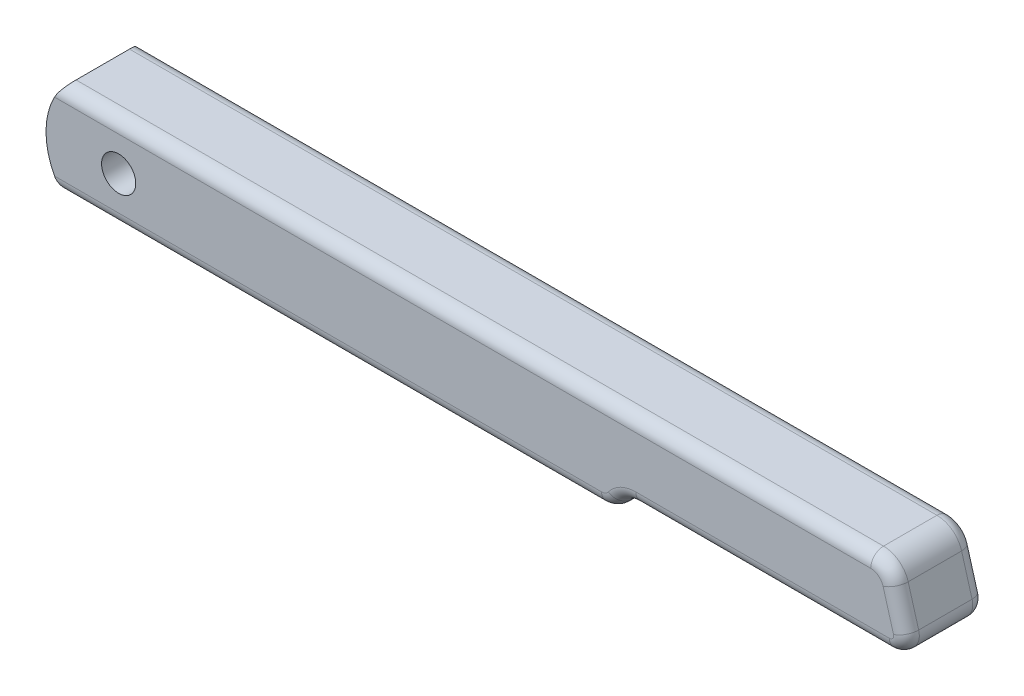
from build123d import *

# Parameters (mm, degrees)
ESQUISSE1_R          = 4
BASE_EXTRUSION_DEPTH = 18.5
CONG_1_R             = 3


with BuildPart() as part:
    # Esquisse1 → Base-Extrusion (new body)
    with BuildSketch(Plane.XY):
        with BuildLine():
            Line((-12.961481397, 11), (175.978675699, 11))
            ThreePointArc((175.978675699, 11), (179.589565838, 9.79181306), (181.746245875, 6.653824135))
            Line((181.746245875, 6.653824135), (184.198284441, -1.897450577))
            ThreePointArc((184.198284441, -1.897450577), (183.547779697, -5.407260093), (180.353237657, -7))
            Line((180.353237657, -7), (121, -7))
            ThreePointArc((121, -7), (118.763932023, -7.527864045), (117, -9))
            ThreePointArc((117, -9), (115.236067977, -10.472135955), (113, -11))
            Line((113, -11), (-12.961481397, -11))
            ThreePointArc((-12.961481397, -11), (-17, 0), (-12.961481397, 11))
        make_face()
        Circle(ESQUISSE1_R, mode=Mode.SUBTRACT)
    extrude(amount=BASE_EXTRUSION_DEPTH)

    # Cong_1
    cong_1_edges = [part.edges().sort_by_distance(p)[0] for p in [
        (81.508597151, 11, 0),
        (81.508597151, 11, 18.5),
        (179.589565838, 9.79181306, 0),
        (179.589565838, 9.79181306, 18.5),
        (182.972265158, 2.378186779, 0),
        (182.972265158, 2.378186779, 18.5),
        (183.547779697, -5.407260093, 0),
        (183.547779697, -5.407260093, 18.5),
        (150.676618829, -7, 0),
        (150.676618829, -7, 18.5),
        (118.763932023, -7.527864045, 0),
        (118.763932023, -7.527864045, 18.5),
        (115.236067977, -10.472135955, 0),
        (115.236067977, -10.472135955, 18.5),
        (50.019259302, -11, 0),
        (50.019259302, -11, 18.5),
    ]]
    fillet(cong_1_edges, radius=CONG_1_R)


solid = part.part
